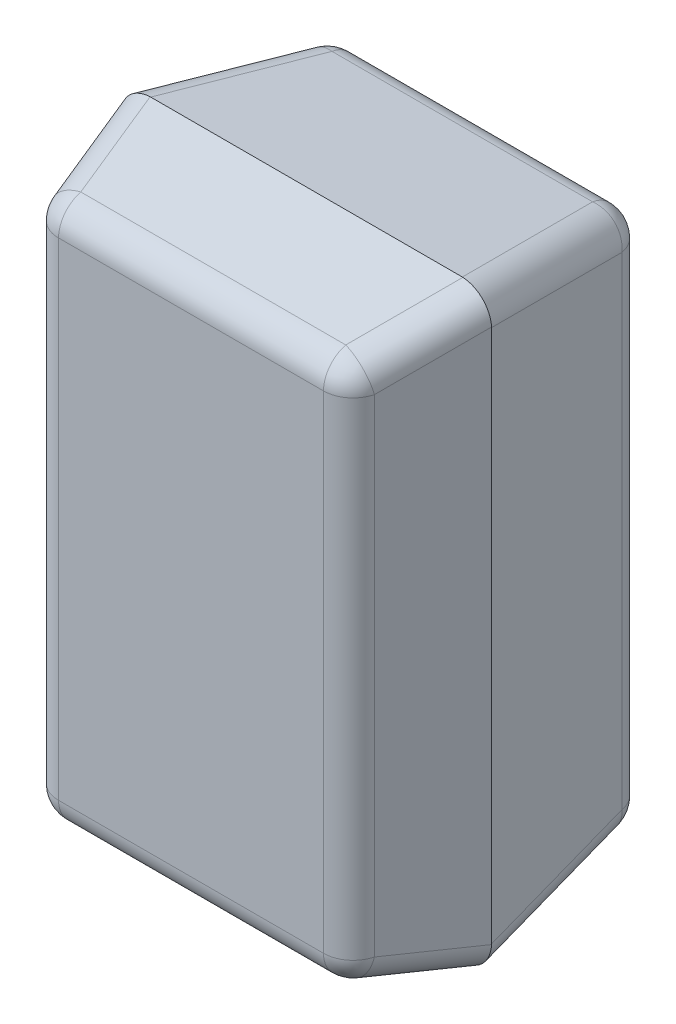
ISO-10303-21;
HEADER;
FILE_DESCRIPTION(('STEP AP214'),'2;1');
FILE_NAME('part.step','',(''),(''),'','','');
FILE_SCHEMA(('AUTOMOTIVE_DESIGN { 1 0 10303 214 1 1 1 1 }'));
ENDSEC;
DATA;
#1=APPLICATION_CONTEXT('core data for automotive mechanical design processes');
#2=APPLICATION_PROTOCOL_DEFINITION('international standard','automotive_design',2000,#1);
#3=PRODUCT_CONTEXT('',#1,'mechanical');
#4=PRODUCT('Part','Part','',(#3));
#5=PRODUCT_RELATED_PRODUCT_CATEGORY('part','',(#4));
#6=PRODUCT_DEFINITION_FORMATION('','',#4);
#7=PRODUCT_DEFINITION_CONTEXT('part definition',#1,'design');
#8=PRODUCT_DEFINITION('design','',#6,#7);
#9=PRODUCT_DEFINITION_SHAPE('','',#8);
#10=(LENGTH_UNIT() NAMED_UNIT(*) SI_UNIT(.MILLI.,.METRE.));
#11=(NAMED_UNIT(*) PLANE_ANGLE_UNIT() SI_UNIT($,.RADIAN.));
#12=(NAMED_UNIT(*) SI_UNIT($,.STERADIAN.) SOLID_ANGLE_UNIT());
#13=UNCERTAINTY_MEASURE_WITH_UNIT(LENGTH_MEASURE(1.E-05),#10,'distance_accuracy_value','');
#14=(GEOMETRIC_REPRESENTATION_CONTEXT(3) GLOBAL_UNCERTAINTY_ASSIGNED_CONTEXT((#13)) GLOBAL_UNIT_ASSIGNED_CONTEXT((#10,
#11,#12)) REPRESENTATION_CONTEXT('',''));
#15=CARTESIAN_POINT('',(0.,0.,0.));
#16=DIRECTION('',(0.,0.,1.));
#17=DIRECTION('',(1.,0.,0.));
#18=AXIS2_PLACEMENT_3D('',#15,#16,#17);
#19=CARTESIAN_POINT('',(0.3125,0.95,0.805));
#20=DIRECTION('',(0.,0.968663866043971,0.248375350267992));
#21=DIRECTION('',(1.,0.,0.));
#22=AXIS2_PLACEMENT_3D('',#19,#20,#21);
#23=PLANE('',#22);
#24=CARTESIAN_POINT('',(0.563185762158,0.938185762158,0.851075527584));
#25=DIRECTION('',(1.20414386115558E-13,-0.96866386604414,-0.248375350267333));
#26=DIRECTION('',(-0.173969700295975,0.244587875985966,-0.953892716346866));
#27=AXIS2_PLACEMENT_3D('',#24,#25,#26);
#28=ELLIPSE('',#27,0.252109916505,0.1);
#29=CARTESIAN_POINT('',(0.526317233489,1.,0.61));
#30=VERTEX_POINT('',#29);
#31=CARTESIAN_POINT('',(0.528123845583,0.999990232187,0.61003809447));
#32=VERTEX_POINT('',#31);
#33=EDGE_CURVE('E417',#30,#32,#28,.T.);
#34=ORIENTED_EDGE('',*,*,#33,.F.);
#35=DIRECTION('',(-1.,0.,0.));
#36=VECTOR('',#35,1.);
#37=CARTESIAN_POINT('',(0.3125,1.,0.61));
#38=LINE('',#37,#36);
#39=CARTESIAN_POINT('',(-0.526317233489,1.,0.61));
#40=VERTEX_POINT('',#39);
#41=EDGE_CURVE('E11',#30,#40,#38,.T.);
#42=ORIENTED_EDGE('',*,*,#41,.T.);
#43=CARTESIAN_POINT('',(-0.563185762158,0.938185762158,0.851075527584));
#44=DIRECTION('',(-1.19984334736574E-13,-0.96866386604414,-0.248375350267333));
#45=DIRECTION('',(0.173969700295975,0.244587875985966,-0.953892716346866));
#46=AXIS2_PLACEMENT_3D('',#43,#44,#45);
#47=ELLIPSE('',#46,0.252109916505,0.1);
#48=CARTESIAN_POINT('',(-0.528123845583,0.999990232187,0.61003809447));
#49=VERTEX_POINT('',#48);
#50=EDGE_CURVE('E459',#49,#40,#47,.T.);
#51=ORIENTED_EDGE('',*,*,#50,.F.);
#52=DIRECTION('',(-0.241051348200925,0.241051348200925,-0.940100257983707));
#53=VECTOR('',#52,1.);
#54=CARTESIAN_POINT('',(-0.444903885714,0.916770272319,0.934595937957));
#55=LINE('',#54,#53);
#56=CARTESIAN_POINT('',(-0.447406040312,0.919272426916,0.924837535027));
#57=VERTEX_POINT('',#56);
#58=EDGE_CURVE('E361',#57,#49,#55,.T.);
#59=ORIENTED_EDGE('',*,*,#58,.F.);
#60=DIRECTION('',(-1.,0.,0.));
#61=VECTOR('',#60,1.);
#62=CARTESIAN_POINT('',(0.15625,0.919272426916,0.924837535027));
#63=LINE('',#62,#61);
#64=CARTESIAN_POINT('',(0.447406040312,0.919272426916,0.924837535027));
#65=VERTEX_POINT('',#64);
#66=EDGE_CURVE('E366',#65,#57,#63,.T.);
#67=ORIENTED_EDGE('',*,*,#66,.F.);
#68=DIRECTION('',(-0.241051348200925,-0.241051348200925,0.940100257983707));
#69=VECTOR('',#68,1.);
#70=CARTESIAN_POINT('',(0.434009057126,0.905875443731,0.97708576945));
#71=LINE('',#70,#69);
#72=EDGE_CURVE('E247',#32,#65,#71,.T.);
#73=ORIENTED_EDGE('',*,*,#72,.F.);
#74=EDGE_LOOP('',(#34,#42,#51,#59,#67,#73));
#75=FACE_BOUND('',#74,.T.);
#76=ADVANCED_FACE('F17',(#75),#23,.T.);
#77=CARTESIAN_POINT('',(-0.575,0.5,0.805));
#78=DIRECTION('',(-0.968663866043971,0.,0.248375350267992));
#79=DIRECTION('',(0.,1.,0.));
#80=AXIS2_PLACEMENT_3D('',#77,#78,#79);
#81=PLANE('',#80);
#82=CARTESIAN_POINT('',(-0.563185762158,0.938185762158,0.851075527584));
#83=DIRECTION('',(0.96866386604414,1.20173557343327E-13,-0.248375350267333));
#84=DIRECTION('',(-0.244587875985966,-0.173969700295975,-0.953892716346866));
#85=AXIS2_PLACEMENT_3D('',#82,#83,#84);
#86=ELLIPSE('',#85,0.252109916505,0.1);
#87=CARTESIAN_POINT('',(-0.625,0.901317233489,0.61));
#88=VERTEX_POINT('',#87);
#89=CARTESIAN_POINT('',(-0.624990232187,0.903123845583,0.61003809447));
#90=VERTEX_POINT('',#89);
#91=EDGE_CURVE('E316',#88,#90,#86,.T.);
#92=ORIENTED_EDGE('',*,*,#91,.F.);
#93=DIRECTION('',(0.,-1.,0.));
#94=VECTOR('',#93,1.);
#95=CARTESIAN_POINT('',(-0.625,0.5,0.61));
#96=LINE('',#95,#94);
#97=CARTESIAN_POINT('',(-0.625,-0.901317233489,0.61));
#98=VERTEX_POINT('',#97);
#99=EDGE_CURVE('E20',#88,#98,#96,.T.);
#100=ORIENTED_EDGE('',*,*,#99,.T.);
#101=CARTESIAN_POINT('',(-0.563185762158,-0.938185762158,0.851075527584));
#102=DIRECTION('',(0.96866386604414,-1.20242365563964E-13,-0.248375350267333));
#103=DIRECTION('',(-0.244587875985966,0.173969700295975,-0.953892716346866));
#104=AXIS2_PLACEMENT_3D('',#101,#102,#103);
#105=ELLIPSE('',#104,0.252109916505,0.1);
#106=CARTESIAN_POINT('',(-0.624990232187,-0.903123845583,0.61003809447));
#107=VERTEX_POINT('',#106);
#108=EDGE_CURVE('E249',#107,#98,#105,.T.);
#109=ORIENTED_EDGE('',*,*,#108,.F.);
#110=DIRECTION('',(-0.241051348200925,-0.241051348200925,-0.940100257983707));
#111=VECTOR('',#110,1.);
#112=CARTESIAN_POINT('',(-0.530875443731,-0.809009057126,0.97708576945));
#113=LINE('',#112,#111);
#114=CARTESIAN_POINT('',(-0.544272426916,-0.822406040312,0.924837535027));
#115=VERTEX_POINT('',#114);
#116=EDGE_CURVE('E414',#115,#107,#113,.T.);
#117=ORIENTED_EDGE('',*,*,#116,.F.);
#118=DIRECTION('',(0.,-1.,0.));
#119=VECTOR('',#118,1.);
#120=CARTESIAN_POINT('',(-0.544272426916,0.25,0.924837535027));
#121=LINE('',#120,#119);
#122=CARTESIAN_POINT('',(-0.544272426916,0.822406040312,0.924837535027));
#123=VERTEX_POINT('',#122);
#124=EDGE_CURVE('E290',#123,#115,#121,.T.);
#125=ORIENTED_EDGE('',*,*,#124,.F.);
#126=DIRECTION('',(0.241051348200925,-0.241051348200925,0.940100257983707));
#127=VECTOR('',#126,1.);
#128=CARTESIAN_POINT('',(-0.541770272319,0.819903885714,0.934595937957));
#129=LINE('',#128,#127);
#130=EDGE_CURVE('E357',#90,#123,#129,.T.);
#131=ORIENTED_EDGE('',*,*,#130,.F.);
#132=EDGE_LOOP('',(#92,#100,#109,#117,#125,#131));
#133=FACE_BOUND('',#132,.T.);
#134=ADVANCED_FACE('F480',(#133),#81,.T.);
#135=CARTESIAN_POINT('',(0.575,-0.5,0.305));
#136=DIRECTION('',(0.986827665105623,0.,-0.161775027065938));
#137=DIRECTION('',(0.,-1.,0.));
#138=AXIS2_PLACEMENT_3D('',#135,#136,#137);
#139=PLANE('',#138);
#140=DIRECTION('',(-0.159698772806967,-0.159698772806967,-0.974162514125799));
#141=VECTOR('',#140,1.);
#142=CARTESIAN_POINT('',(0.555679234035,0.831996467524,0.187143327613));
#143=LINE('',#142,#141);
#144=CARTESIAN_POINT('',(0.625,0.901317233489,0.61));
#145=VERTEX_POINT('',#144);
#146=CARTESIAN_POINT('',(0.538741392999,0.815058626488,0.08382249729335));
#147=VERTEX_POINT('',#146);
#148=EDGE_CURVE('E199',#145,#147,#143,.T.);
#149=ORIENTED_EDGE('',*,*,#148,.F.);
#150=DIRECTION('',(0.,1.,0.));
#151=VECTOR('',#150,1.);
#152=CARTESIAN_POINT('',(0.625,-0.5,0.61));
#153=LINE('',#152,#151);
#154=CARTESIAN_POINT('',(0.625,-0.901317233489,0.61));
#155=VERTEX_POINT('',#154);
#156=EDGE_CURVE('E46',#155,#145,#153,.T.);
#157=ORIENTED_EDGE('',*,*,#156,.F.);
#158=DIRECTION('',(0.159698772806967,-0.159698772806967,0.974162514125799));
#159=VECTOR('',#158,1.);
#160=CARTESIAN_POINT('',(0.560461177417,-0.836778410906,0.216313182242));
#161=LINE('',#160,#159);
#162=CARTESIAN_POINT('',(0.538741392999,-0.815058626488,0.08382249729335));
#163=VERTEX_POINT('',#162);
#164=EDGE_CURVE('E217',#163,#155,#161,.T.);
#165=ORIENTED_EDGE('',*,*,#164,.F.);
#166=DIRECTION('',(0.,-1.,0.));
#167=VECTOR('',#166,1.);
#168=CARTESIAN_POINT('',(0.538741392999,-0.25,0.08382249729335));
#169=LINE('',#168,#167);
#170=EDGE_CURVE('E214',#147,#163,#169,.T.);
#171=ORIENTED_EDGE('',*,*,#170,.F.);
#172=EDGE_LOOP('',(#149,#157,#165,#171));
#173=FACE_BOUND('',#172,.T.);
#174=ADVANCED_FACE('F215',(#173),#139,.T.);
#175=CARTESIAN_POINT('',(-0.3125,-0.95,0.305));
#176=DIRECTION('',(0.,-0.986827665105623,-0.161775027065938));
#177=DIRECTION('',(0.,0.161775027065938,-0.986827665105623));
#178=AXIS2_PLACEMENT_3D('',#175,#176,#177);
#179=PLANE('',#178);
#180=DIRECTION('',(-0.159698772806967,0.159698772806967,-0.974162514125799));
#181=VECTOR('',#180,1.);
#182=CARTESIAN_POINT('',(0.461778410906,-0.935461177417,0.216313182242));
#183=LINE('',#182,#181);
#184=CARTESIAN_POINT('',(0.526317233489,-1.,0.61));
#185=VERTEX_POINT('',#184);
#186=CARTESIAN_POINT('',(0.440058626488,-0.913741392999,0.08382249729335));
#187=VERTEX_POINT('',#186);
#188=EDGE_CURVE('E302',#185,#187,#183,.T.);
#189=ORIENTED_EDGE('',*,*,#188,.F.);
#190=DIRECTION('',(1.,0.,0.));
#191=VECTOR('',#190,1.);
#192=CARTESIAN_POINT('',(-0.3125,-1.,0.61));
#193=LINE('',#192,#191);
#194=CARTESIAN_POINT('',(-0.526317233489,-1.,0.61));
#195=VERTEX_POINT('',#194);
#196=EDGE_CURVE('E336',#195,#185,#193,.T.);
#197=ORIENTED_EDGE('',*,*,#196,.F.);
#198=DIRECTION('',(-0.159698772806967,-0.159698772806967,0.974162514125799));
#199=VECTOR('',#198,1.);
#200=CARTESIAN_POINT('',(-0.456996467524,-0.930679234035,0.187143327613));
#201=LINE('',#200,#199);
#202=CARTESIAN_POINT('',(-0.440058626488,-0.913741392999,0.08382249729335));
#203=VERTEX_POINT('',#202);
#204=EDGE_CURVE('E367',#203,#195,#201,.T.);
#205=ORIENTED_EDGE('',*,*,#204,.F.);
#206=DIRECTION('',(-1.,0.,0.));
#207=VECTOR('',#206,1.);
#208=CARTESIAN_POINT('',(-0.15625,-0.913741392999,0.08382249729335));
#209=LINE('',#208,#207);
#210=EDGE_CURVE('E321',#187,#203,#209,.T.);
#211=ORIENTED_EDGE('',*,*,#210,.F.);
#212=EDGE_LOOP('',(#189,#197,#205,#211));
#213=FACE_BOUND('',#212,.T.);
#214=ADVANCED_FACE('F524',(#213),#179,.T.);
#215=CARTESIAN_POINT('',(0.,0.,0.));
#216=DIRECTION('',(0.,0.,1.));
#217=DIRECTION('',(1.,0.,0.));
#218=AXIS2_PLACEMENT_3D('',#215,#216,#217);
#219=PLANE('',#218);
#220=DIRECTION('',(0.,-1.,0.));
#221=VECTOR('',#220,1.);
#222=CARTESIAN_POINT('',(-0.440058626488,0.25,0.));
#223=LINE('',#222,#221);
#224=CARTESIAN_POINT('',(-0.440058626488,0.815058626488,0.));
#225=VERTEX_POINT('',#224);
#226=CARTESIAN_POINT('',(-0.440058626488,-0.815058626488,0.));
#227=VERTEX_POINT('',#226);
#228=EDGE_CURVE('E447',#225,#227,#223,.T.);
#229=ORIENTED_EDGE('',*,*,#228,.F.);
#230=DIRECTION('',(-1.,0.,0.));
#231=VECTOR('',#230,1.);
#232=CARTESIAN_POINT('',(0.15625,0.815058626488,0.));
#233=LINE('',#232,#231);
#234=CARTESIAN_POINT('',(0.440058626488,0.815058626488,0.));
#235=VERTEX_POINT('',#234);
#236=EDGE_CURVE('E211',#235,#225,#233,.T.);
#237=ORIENTED_EDGE('',*,*,#236,.F.);
#238=DIRECTION('',(0.,1.,0.));
#239=VECTOR('',#238,1.);
#240=CARTESIAN_POINT('',(0.440058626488,-0.25,0.));
#241=LINE('',#240,#239);
#242=CARTESIAN_POINT('',(0.440058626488,-0.815058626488,0.));
#243=VERTEX_POINT('',#242);
#244=EDGE_CURVE('E223',#243,#235,#241,.T.);
#245=ORIENTED_EDGE('',*,*,#244,.F.);
#246=DIRECTION('',(1.,0.,0.));
#247=VECTOR('',#246,1.);
#248=CARTESIAN_POINT('',(-0.15625,-0.815058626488,0.));
#249=LINE('',#248,#247);
#250=EDGE_CURVE('E318',#227,#243,#249,.T.);
#251=ORIENTED_EDGE('',*,*,#250,.F.);
#252=EDGE_LOOP('',(#229,#237,#245,#251));
#253=FACE_BOUND('',#252,.T.);
#254=ADVANCED_FACE('F505',(#253),#219,.F.);
#255=CARTESIAN_POINT('',(0.,0.,1.));
#256=DIRECTION('',(0.,0.,1.));
#257=DIRECTION('',(1.,0.,0.));
#258=AXIS2_PLACEMENT_3D('',#255,#256,#257);
#259=PLANE('',#258);
#260=DIRECTION('',(1.,0.,0.));
#261=VECTOR('',#260,1.);
#262=CARTESIAN_POINT('',(0.15625,0.822406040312,1.));
#263=LINE('',#262,#261);
#264=CARTESIAN_POINT('',(-0.447406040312,0.822406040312,1.));
#265=VERTEX_POINT('',#264);
#266=CARTESIAN_POINT('',(0.447406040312,0.822406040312,1.));
#267=VERTEX_POINT('',#266);
#268=EDGE_CURVE('E362',#265,#267,#263,.T.);
#269=ORIENTED_EDGE('',*,*,#268,.F.);
#270=DIRECTION('',(0.,1.,0.));
#271=VECTOR('',#270,1.);
#272=CARTESIAN_POINT('',(-0.447406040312,0.25,1.));
#273=LINE('',#272,#271);
#274=CARTESIAN_POINT('',(-0.447406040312,-0.822406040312,1.));
#275=VERTEX_POINT('',#274);
#276=EDGE_CURVE('E286',#275,#265,#273,.T.);
#277=ORIENTED_EDGE('',*,*,#276,.F.);
#278=DIRECTION('',(-1.,0.,0.));
#279=VECTOR('',#278,1.);
#280=CARTESIAN_POINT('',(-0.15625,-0.822406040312,1.));
#281=LINE('',#280,#279);
#282=CARTESIAN_POINT('',(0.447406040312,-0.822406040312,1.));
#283=VERTEX_POINT('',#282);
#284=EDGE_CURVE('E434',#283,#275,#281,.T.);
#285=ORIENTED_EDGE('',*,*,#284,.F.);
#286=DIRECTION('',(0.,-1.,0.));
#287=VECTOR('',#286,1.);
#288=CARTESIAN_POINT('',(0.447406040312,-0.25,1.));
#289=LINE('',#288,#287);
#290=EDGE_CURVE('E383',#267,#283,#289,.T.);
#291=ORIENTED_EDGE('',*,*,#290,.F.);
#292=EDGE_LOOP('',(#269,#277,#285,#291));
#293=FACE_BOUND('',#292,.T.);
#294=ADVANCED_FACE('F880',(#293),#259,.T.);
#295=CARTESIAN_POINT('',(0.3125,0.95,0.305));
#296=DIRECTION('',(0.,0.986827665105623,-0.161775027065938));
#297=DIRECTION('',(-1.,0.,0.));
#298=AXIS2_PLACEMENT_3D('',#295,#296,#297);
#299=PLANE('',#298);
#300=DIRECTION('',(0.159698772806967,0.159698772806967,0.974162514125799));
#301=VECTOR('',#300,1.);
#302=CARTESIAN_POINT('',(0.456996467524,0.930679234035,0.187143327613));
#303=LINE('',#302,#301);
#304=CARTESIAN_POINT('',(0.440058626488,0.913741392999,0.08382249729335));
#305=VERTEX_POINT('',#304);
#306=EDGE_CURVE('E210',#305,#30,#303,.T.);
#307=ORIENTED_EDGE('',*,*,#306,.F.);
#308=DIRECTION('',(1.,0.,0.));
#309=VECTOR('',#308,1.);
#310=CARTESIAN_POINT('',(0.15625,0.913741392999,0.08382249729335));
#311=LINE('',#310,#309);
#312=CARTESIAN_POINT('',(-0.440058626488,0.913741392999,0.08382249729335));
#313=VERTEX_POINT('',#312);
#314=EDGE_CURVE('E463',#313,#305,#311,.T.);
#315=ORIENTED_EDGE('',*,*,#314,.F.);
#316=DIRECTION('',(0.159698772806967,-0.159698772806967,-0.974162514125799));
#317=VECTOR('',#316,1.);
#318=CARTESIAN_POINT('',(-0.461778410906,0.935461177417,0.216313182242));
#319=LINE('',#318,#317);
#320=EDGE_CURVE('E317',#40,#313,#319,.T.);
#321=ORIENTED_EDGE('',*,*,#320,.F.);
#322=ORIENTED_EDGE('',*,*,#41,.F.);
#323=EDGE_LOOP('',(#307,#315,#321,#322));
#324=FACE_BOUND('',#323,.T.);
#325=ADVANCED_FACE('F872',(#324),#299,.T.);
#326=CARTESIAN_POINT('',(-0.575,0.5,0.305));
#327=DIRECTION('',(-0.986827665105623,0.,-0.161775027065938));
#328=DIRECTION('',(-0.161775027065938,0.,0.986827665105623));
#329=AXIS2_PLACEMENT_3D('',#326,#327,#328);
#330=PLANE('',#329);
#331=DIRECTION('',(-0.159698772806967,0.159698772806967,0.974162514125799));
#332=VECTOR('',#331,1.);
#333=CARTESIAN_POINT('',(-0.560461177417,0.836778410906,0.216313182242));
#334=LINE('',#333,#332);
#335=CARTESIAN_POINT('',(-0.538741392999,0.815058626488,0.08382249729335));
#336=VERTEX_POINT('',#335);
#337=EDGE_CURVE('E312',#336,#88,#334,.T.);
#338=ORIENTED_EDGE('',*,*,#337,.F.);
#339=DIRECTION('',(0.,1.,0.));
#340=VECTOR('',#339,1.);
#341=CARTESIAN_POINT('',(-0.538741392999,0.25,0.08382249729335));
#342=LINE('',#341,#340);
#343=CARTESIAN_POINT('',(-0.538741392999,-0.815058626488,0.08382249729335));
#344=VERTEX_POINT('',#343);
#345=EDGE_CURVE('E289',#344,#336,#342,.T.);
#346=ORIENTED_EDGE('',*,*,#345,.F.);
#347=DIRECTION('',(0.159698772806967,0.159698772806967,-0.974162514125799));
#348=VECTOR('',#347,1.);
#349=CARTESIAN_POINT('',(-0.555679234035,-0.831996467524,0.187143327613));
#350=LINE('',#349,#348);
#351=EDGE_CURVE('E371',#98,#344,#350,.T.);
#352=ORIENTED_EDGE('',*,*,#351,.F.);
#353=ORIENTED_EDGE('',*,*,#99,.F.);
#354=EDGE_LOOP('',(#338,#346,#352,#353));
#355=FACE_BOUND('',#354,.T.);
#356=ADVANCED_FACE('F490',(#355),#330,.T.);
#357=CARTESIAN_POINT('',(-0.3125,-0.95,0.805));
#358=DIRECTION('',(0.,-0.968663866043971,0.248375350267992));
#359=DIRECTION('',(-1.,0.,0.));
#360=AXIS2_PLACEMENT_3D('',#357,#358,#359);
#361=PLANE('',#360);
#362=CARTESIAN_POINT('',(0.563185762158,-0.938185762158,0.851075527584));
#363=DIRECTION('',(1.20104749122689E-13,0.96866386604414,-0.248375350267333));
#364=DIRECTION('',(-0.173969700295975,-0.244587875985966,-0.953892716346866));
#365=AXIS2_PLACEMENT_3D('',#362,#363,#364);
#366=ELLIPSE('',#365,0.252109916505,0.1);
#367=CARTESIAN_POINT('',(0.528123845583,-0.999990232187,0.61003809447));
#368=VERTEX_POINT('',#367);
#369=EDGE_CURVE('E440',#368,#185,#366,.T.);
#370=ORIENTED_EDGE('',*,*,#369,.F.);
#371=DIRECTION('',(0.241051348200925,-0.241051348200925,-0.940100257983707));
#372=VECTOR('',#371,1.);
#373=CARTESIAN_POINT('',(0.444903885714,-0.916770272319,0.934595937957));
#374=LINE('',#373,#372);
#375=CARTESIAN_POINT('',(0.447406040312,-0.919272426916,0.924837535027));
#376=VERTEX_POINT('',#375);
#377=EDGE_CURVE('E330',#376,#368,#374,.T.);
#378=ORIENTED_EDGE('',*,*,#377,.F.);
#379=DIRECTION('',(1.,0.,0.));
#380=VECTOR('',#379,1.);
#381=CARTESIAN_POINT('',(-0.15625,-0.919272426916,0.924837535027));
#382=LINE('',#381,#380);
#383=CARTESIAN_POINT('',(-0.447406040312,-0.919272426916,0.924837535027));
#384=VERTEX_POINT('',#383);
#385=EDGE_CURVE('E253',#384,#376,#382,.T.);
#386=ORIENTED_EDGE('',*,*,#385,.F.);
#387=DIRECTION('',(0.241051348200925,0.241051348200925,0.940100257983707));
#388=VECTOR('',#387,1.);
#389=CARTESIAN_POINT('',(-0.434009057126,-0.905875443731,0.97708576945));
#390=LINE('',#389,#388);
#391=CARTESIAN_POINT('',(-0.528123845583,-0.999990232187,0.61003809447));
#392=VERTEX_POINT('',#391);
#393=EDGE_CURVE('E340',#392,#384,#390,.T.);
#394=ORIENTED_EDGE('',*,*,#393,.F.);
#395=CARTESIAN_POINT('',(-0.563185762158,-0.938185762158,0.851075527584));
#396=DIRECTION('',(-1.20302572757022E-13,0.96866386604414,-0.248375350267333));
#397=DIRECTION('',(0.173969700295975,-0.244587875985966,-0.953892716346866));
#398=AXIS2_PLACEMENT_3D('',#395,#396,#397);
#399=ELLIPSE('',#398,0.252109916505,0.1);
#400=EDGE_CURVE('E254',#195,#392,#399,.T.);
#401=ORIENTED_EDGE('',*,*,#400,.F.);
#402=ORIENTED_EDGE('',*,*,#196,.T.);
#403=EDGE_LOOP('',(#370,#378,#386,#394,#401,#402));
#404=FACE_BOUND('',#403,.T.);
#405=ADVANCED_FACE('F530',(#404),#361,.T.);
#406=CARTESIAN_POINT('',(0.575,-0.5,0.805));
#407=DIRECTION('',(0.968663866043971,0.,0.248375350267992));
#408=DIRECTION('',(0.,-1.,0.));
#409=AXIS2_PLACEMENT_3D('',#406,#407,#408);
#410=PLANE('',#409);
#411=CARTESIAN_POINT('',(0.563185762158,0.938185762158,0.851075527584));
#412=DIRECTION('',(-0.96866386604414,1.2008754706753E-13,-0.248375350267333));
#413=DIRECTION('',(0.244587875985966,-0.173969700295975,-0.953892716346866));
#414=AXIS2_PLACEMENT_3D('',#411,#412,#413);
#415=ELLIPSE('',#414,0.252109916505,0.1);
#416=CARTESIAN_POINT('',(0.624990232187,0.903123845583,0.61003809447));
#417=VERTEX_POINT('',#416);
#418=EDGE_CURVE('E207',#417,#145,#415,.T.);
#419=ORIENTED_EDGE('',*,*,#418,.F.);
#420=DIRECTION('',(0.241051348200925,0.241051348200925,-0.940100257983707));
#421=VECTOR('',#420,1.);
#422=CARTESIAN_POINT('',(0.530875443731,0.809009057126,0.97708576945));
#423=LINE('',#422,#421);
#424=CARTESIAN_POINT('',(0.544272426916,0.822406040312,0.924837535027));
#425=VERTEX_POINT('',#424);
#426=EDGE_CURVE('E282',#425,#417,#423,.T.);
#427=ORIENTED_EDGE('',*,*,#426,.F.);
#428=DIRECTION('',(0.,1.,0.));
#429=VECTOR('',#428,1.);
#430=CARTESIAN_POINT('',(0.544272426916,-0.25,0.924837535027));
#431=LINE('',#430,#429);
#432=CARTESIAN_POINT('',(0.544272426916,-0.822406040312,0.924837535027));
#433=VERTEX_POINT('',#432);
#434=EDGE_CURVE('E329',#433,#425,#431,.T.);
#435=ORIENTED_EDGE('',*,*,#434,.F.);
#436=DIRECTION('',(-0.241051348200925,0.241051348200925,0.940100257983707));
#437=VECTOR('',#436,1.);
#438=CARTESIAN_POINT('',(0.541770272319,-0.819903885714,0.934595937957));
#439=LINE('',#438,#437);
#440=CARTESIAN_POINT('',(0.624990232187,-0.903123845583,0.61003809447));
#441=VERTEX_POINT('',#440);
#442=EDGE_CURVE('E394',#441,#433,#439,.T.);
#443=ORIENTED_EDGE('',*,*,#442,.F.);
#444=CARTESIAN_POINT('',(0.563185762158,-0.938185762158,0.851075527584));
#445=DIRECTION('',(-0.96866386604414,-1.20328375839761E-13,-0.248375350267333));
#446=DIRECTION('',(0.244587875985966,0.173969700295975,-0.953892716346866));
#447=AXIS2_PLACEMENT_3D('',#444,#445,#446);
#448=ELLIPSE('',#447,0.252109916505,0.1);
#449=EDGE_CURVE('E301',#155,#441,#448,.T.);
#450=ORIENTED_EDGE('',*,*,#449,.F.);
#451=ORIENTED_EDGE('',*,*,#156,.T.);
#452=EDGE_LOOP('',(#419,#427,#435,#443,#450,#451));
#453=FACE_BOUND('',#452,.T.);
#454=ADVANCED_FACE('F850',(#453),#410,.T.);
#455=CARTESIAN_POINT('',(0.456996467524,0.831996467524,0.20332083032));
#456=DIRECTION('',(-0.159698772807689,-0.159698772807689,-0.974162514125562));
#457=DIRECTION('',(0.688836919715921,0.688836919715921,-0.225848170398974));
#458=AXIS2_PLACEMENT_3D('',#455,#456,#457);
#459=CYLINDRICAL_SURFACE('',#458,0.1);
#460=ORIENTED_EDGE('',*,*,#148,.T.);
#461=CARTESIAN_POINT('',(0.440058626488,0.815058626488,0.1));
#462=DIRECTION('',(-0.159698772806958,-0.159698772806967,-0.9741625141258));
#463=DIRECTION('',(0.986827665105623,0.,-0.161775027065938));
#464=AXIS2_PLACEMENT_3D('',#461,#462,#463);
#465=CIRCLE('',#464,0.1);
#466=EDGE_CURVE('E204',#305,#147,#465,.T.);
#467=ORIENTED_EDGE('',*,*,#466,.F.);
#468=ORIENTED_EDGE('',*,*,#306,.T.);
#469=ORIENTED_EDGE('',*,*,#33,.T.);
#470=CARTESIAN_POINT('',(0.52292411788,0.89792411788,0.605479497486));
#471=DIRECTION('',(-0.0424215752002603,-0.0424215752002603,0.998198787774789));
#472=DIRECTION('',(0.705833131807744,0.705833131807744,0.0599931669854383));
#473=AXIS2_PLACEMENT_3D('',#470,#471,#472);
#474=ELLIPSE('',#473,0.104290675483,0.1);
#475=EDGE_CURVE('E281',#417,#32,#474,.T.);
#476=ORIENTED_EDGE('',*,*,#475,.F.);
#477=ORIENTED_EDGE('',*,*,#418,.T.);
#478=EDGE_LOOP('',(#460,#467,#468,#469,#476,#477));
#479=FACE_BOUND('',#478,.T.);
#480=ADVANCED_FACE('F201',(#479),#459,.T.);
#481=CARTESIAN_POINT('',(0.15625,0.815058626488,0.1));
#482=DIRECTION('',(-1.,0.,0.));
#483=DIRECTION('',(0.,0.64738897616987,-0.762159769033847));
#484=AXIS2_PLACEMENT_3D('',#481,#482,#483);
#485=CYLINDRICAL_SURFACE('',#484,0.1);
#486=CARTESIAN_POINT('',(-0.440058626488,0.815058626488,0.1));
#487=DIRECTION('',(-1.,0.,0.));
#488=DIRECTION('',(0.,0.,-1.));
#489=AXIS2_PLACEMENT_3D('',#486,#487,#488);
#490=CIRCLE('',#489,0.1);
#491=EDGE_CURVE('E260',#313,#225,#490,.T.);
#492=ORIENTED_EDGE('',*,*,#491,.F.);
#493=ORIENTED_EDGE('',*,*,#314,.T.);
#494=CARTESIAN_POINT('',(0.440058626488,0.815058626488,0.1));
#495=DIRECTION('',(1.,0.,0.));
#496=DIRECTION('',(0.,0.986827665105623,-0.161775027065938));
#497=AXIS2_PLACEMENT_3D('',#494,#495,#496);
#498=CIRCLE('',#497,0.1);
#499=EDGE_CURVE('E231',#235,#305,#498,.T.);
#500=ORIENTED_EDGE('',*,*,#499,.F.);
#501=ORIENTED_EDGE('',*,*,#236,.T.);
#502=EDGE_LOOP('',(#492,#493,#500,#501));
#503=FACE_BOUND('',#502,.T.);
#504=ADVANCED_FACE('F502',(#503),#485,.T.);
#505=CARTESIAN_POINT('',(-0.461778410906,0.836778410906,0.232490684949));
#506=DIRECTION('',(0.159698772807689,-0.159698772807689,-0.974162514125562));
#507=DIRECTION('',(-0.688836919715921,0.688836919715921,-0.225848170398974));
#508=AXIS2_PLACEMENT_3D('',#505,#506,#507);
#509=CYLINDRICAL_SURFACE('',#508,0.1);
#510=ORIENTED_EDGE('',*,*,#320,.T.);
#511=CARTESIAN_POINT('',(-0.440058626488,0.815058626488,0.1));
#512=DIRECTION('',(0.159698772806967,-0.159698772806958,-0.9741625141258));
#513=DIRECTION('',(0.,0.986827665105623,-0.161775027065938));
#514=AXIS2_PLACEMENT_3D('',#511,#512,#513);
#515=CIRCLE('',#514,0.1);
#516=EDGE_CURVE('E261',#336,#313,#515,.T.);
#517=ORIENTED_EDGE('',*,*,#516,.F.);
#518=ORIENTED_EDGE('',*,*,#337,.T.);
#519=ORIENTED_EDGE('',*,*,#91,.T.);
#520=CARTESIAN_POINT('',(-0.52292411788,0.89792411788,0.605479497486));
#521=DIRECTION('',(0.0424215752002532,-0.0424215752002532,0.998198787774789));
#522=DIRECTION('',(0.705833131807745,-0.705833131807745,-0.0599931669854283));
#523=AXIS2_PLACEMENT_3D('',#520,#521,#522);
#524=ELLIPSE('',#523,0.104290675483,0.1);
#525=EDGE_CURVE('E277',#49,#90,#524,.T.);
#526=ORIENTED_EDGE('',*,*,#525,.F.);
#527=ORIENTED_EDGE('',*,*,#50,.T.);
#528=EDGE_LOOP('',(#510,#517,#518,#519,#526,#527));
#529=FACE_BOUND('',#528,.T.);
#530=ADVANCED_FACE('F497',(#529),#509,.T.);
#531=CARTESIAN_POINT('',(0.461778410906,-0.836778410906,0.232490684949));
#532=DIRECTION('',(0.159698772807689,-0.159698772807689,0.974162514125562));
#533=DIRECTION('',(0.688836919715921,-0.688836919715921,-0.225848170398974));
#534=AXIS2_PLACEMENT_3D('',#531,#532,#533);
#535=CYLINDRICAL_SURFACE('',#534,0.1);
#536=ORIENTED_EDGE('',*,*,#188,.T.);
#537=CARTESIAN_POINT('',(0.440058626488,-0.815058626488,0.1));
#538=DIRECTION('',(-0.159698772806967,0.159698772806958,-0.9741625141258));
#539=DIRECTION('',(0.,-0.986827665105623,-0.161775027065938));
#540=AXIS2_PLACEMENT_3D('',#537,#538,#539);
#541=CIRCLE('',#540,0.1);
#542=EDGE_CURVE('E224',#163,#187,#541,.T.);
#543=ORIENTED_EDGE('',*,*,#542,.F.);
#544=ORIENTED_EDGE('',*,*,#164,.T.);
#545=ORIENTED_EDGE('',*,*,#449,.T.);
#546=CARTESIAN_POINT('',(0.52292411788,-0.89792411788,0.605479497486));
#547=DIRECTION('',(-0.0424215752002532,0.0424215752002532,0.998198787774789));
#548=DIRECTION('',(0.705833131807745,-0.705833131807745,0.0599931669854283));
#549=AXIS2_PLACEMENT_3D('',#546,#547,#548);
#550=ELLIPSE('',#549,0.104290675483,0.1);
#551=EDGE_CURVE('E325',#368,#441,#550,.T.);
#552=ORIENTED_EDGE('',*,*,#551,.F.);
#553=ORIENTED_EDGE('',*,*,#369,.T.);
#554=EDGE_LOOP('',(#536,#543,#544,#545,#552,#553));
#555=FACE_BOUND('',#554,.T.);
#556=ADVANCED_FACE('F820',(#555),#535,.T.);
#557=CARTESIAN_POINT('',(-0.15625,-0.815058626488,0.1));
#558=DIRECTION('',(1.,0.,0.));
#559=DIRECTION('',(0.,-0.64738897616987,-0.762159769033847));
#560=AXIS2_PLACEMENT_3D('',#557,#558,#559);
#561=CYLINDRICAL_SURFACE('',#560,0.1);
#562=CARTESIAN_POINT('',(0.440058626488,-0.815058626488,0.1));
#563=DIRECTION('',(1.,0.,0.));
#564=DIRECTION('',(0.,0.,-1.));
#565=AXIS2_PLACEMENT_3D('',#562,#563,#564);
#566=CIRCLE('',#565,0.1);
#567=EDGE_CURVE('E255',#187,#243,#566,.T.);
#568=ORIENTED_EDGE('',*,*,#567,.F.);
#569=ORIENTED_EDGE('',*,*,#210,.T.);
#570=CARTESIAN_POINT('',(-0.440058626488,-0.815058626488,0.1));
#571=DIRECTION('',(-1.,0.,0.));
#572=DIRECTION('',(0.,-0.986827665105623,-0.161775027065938));
#573=AXIS2_PLACEMENT_3D('',#570,#571,#572);
#574=CIRCLE('',#573,0.1);
#575=EDGE_CURVE('E403',#227,#203,#574,.T.);
#576=ORIENTED_EDGE('',*,*,#575,.F.);
#577=ORIENTED_EDGE('',*,*,#250,.T.);
#578=EDGE_LOOP('',(#568,#569,#576,#577));
#579=FACE_BOUND('',#578,.T.);
#580=ADVANCED_FACE('F519',(#579),#561,.T.);
#581=CARTESIAN_POINT('',(-0.440058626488,0.25,0.1));
#582=DIRECTION('',(0.,-1.,0.));
#583=DIRECTION('',(-0.64738897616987,0.,-0.762159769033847));
#584=AXIS2_PLACEMENT_3D('',#581,#582,#583);
#585=CYLINDRICAL_SURFACE('',#584,0.1);
#586=CARTESIAN_POINT('',(-0.440058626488,-0.815058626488,0.1));
#587=DIRECTION('',(0.,-1.,0.));
#588=DIRECTION('',(0.,0.,-1.));
#589=AXIS2_PLACEMENT_3D('',#586,#587,#588);
#590=CIRCLE('',#589,0.1);
#591=EDGE_CURVE('E270',#344,#227,#590,.T.);
#592=ORIENTED_EDGE('',*,*,#591,.F.);
#593=ORIENTED_EDGE('',*,*,#345,.T.);
#594=CARTESIAN_POINT('',(-0.440058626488,0.815058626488,0.1));
#595=DIRECTION('',(0.,1.,0.));
#596=DIRECTION('',(-0.986827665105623,0.,-0.161775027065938));
#597=AXIS2_PLACEMENT_3D('',#594,#595,#596);
#598=CIRCLE('',#597,0.1);
#599=EDGE_CURVE('E264',#225,#336,#598,.T.);
#600=ORIENTED_EDGE('',*,*,#599,.F.);
#601=ORIENTED_EDGE('',*,*,#228,.T.);
#602=EDGE_LOOP('',(#592,#593,#600,#601));
#603=FACE_BOUND('',#602,.T.);
#604=ADVANCED_FACE('F494',(#603),#585,.T.);
#605=CARTESIAN_POINT('',(-0.447406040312,0.25,0.9));
#606=DIRECTION('',(0.,1.,0.));
#607=DIRECTION('',(-0.613035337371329,0.,0.790055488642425));
#608=AXIS2_PLACEMENT_3D('',#605,#606,#607);
#609=CYLINDRICAL_SURFACE('',#608,0.1);
#610=CARTESIAN_POINT('',(-0.447406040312,0.822406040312,0.9));
#611=DIRECTION('',(0.,1.,0.));
#612=DIRECTION('',(0.,0.,1.));
#613=AXIS2_PLACEMENT_3D('',#610,#611,#612);
#614=CIRCLE('',#613,0.1);
#615=EDGE_CURVE('E344',#123,#265,#614,.T.);
#616=ORIENTED_EDGE('',*,*,#615,.F.);
#617=ORIENTED_EDGE('',*,*,#124,.T.);
#618=CARTESIAN_POINT('',(-0.447406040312,-0.822406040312,0.9));
#619=DIRECTION('',(0.,-1.,0.));
#620=DIRECTION('',(-0.968663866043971,0.,0.248375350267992));
#621=AXIS2_PLACEMENT_3D('',#618,#619,#620);
#622=CIRCLE('',#621,0.1);
#623=EDGE_CURVE('E266',#275,#115,#622,.T.);
#624=ORIENTED_EDGE('',*,*,#623,.F.);
#625=ORIENTED_EDGE('',*,*,#276,.T.);
#626=EDGE_LOOP('',(#616,#617,#624,#625));
#627=FACE_BOUND('',#626,.T.);
#628=ADVANCED_FACE('F541',(#627),#609,.T.);
#629=CARTESIAN_POINT('',(-0.15625,-0.822406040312,0.9));
#630=DIRECTION('',(-1.,0.,0.));
#631=DIRECTION('',(0.,-0.613035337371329,0.790055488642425));
#632=AXIS2_PLACEMENT_3D('',#629,#630,#631);
#633=CYLINDRICAL_SURFACE('',#632,0.1);
#634=CARTESIAN_POINT('',(-0.447406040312,-0.822406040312,0.9));
#635=DIRECTION('',(-1.,0.,0.));
#636=DIRECTION('',(0.,0.,1.));
#637=AXIS2_PLACEMENT_3D('',#634,#635,#636);
#638=CIRCLE('',#637,0.1);
#639=EDGE_CURVE('E337',#384,#275,#638,.T.);
#640=ORIENTED_EDGE('',*,*,#639,.F.);
#641=ORIENTED_EDGE('',*,*,#385,.T.);
#642=CARTESIAN_POINT('',(0.447406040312,-0.822406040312,0.9));
#643=DIRECTION('',(1.,0.,0.));
#644=DIRECTION('',(0.,-0.968663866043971,0.248375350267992));
#645=AXIS2_PLACEMENT_3D('',#642,#643,#644);
#646=CIRCLE('',#645,0.1);
#647=EDGE_CURVE('E272',#283,#376,#646,.T.);
#648=ORIENTED_EDGE('',*,*,#647,.F.);
#649=ORIENTED_EDGE('',*,*,#284,.T.);
#650=EDGE_LOOP('',(#640,#641,#648,#649));
#651=FACE_BOUND('',#650,.T.);
#652=ADVANCED_FACE('F535',(#651),#633,.T.);
#653=CARTESIAN_POINT('',(-0.456996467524,-0.831996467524,0.20332083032));
#654=DIRECTION('',(0.159698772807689,0.159698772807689,-0.974162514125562));
#655=DIRECTION('',(-0.688836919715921,-0.688836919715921,-0.225848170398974));
#656=AXIS2_PLACEMENT_3D('',#653,#654,#655);
#657=CYLINDRICAL_SURFACE('',#656,0.1);
#658=ORIENTED_EDGE('',*,*,#351,.T.);
#659=CARTESIAN_POINT('',(-0.440058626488,-0.815058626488,0.1));
#660=DIRECTION('',(0.159698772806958,0.159698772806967,-0.9741625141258));
#661=DIRECTION('',(-0.986827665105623,0.,-0.161775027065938));
#662=AXIS2_PLACEMENT_3D('',#659,#660,#661);
#663=CIRCLE('',#662,0.1);
#664=EDGE_CURVE('E356',#203,#344,#663,.T.);
#665=ORIENTED_EDGE('',*,*,#664,.F.);
#666=ORIENTED_EDGE('',*,*,#204,.T.);
#667=ORIENTED_EDGE('',*,*,#400,.T.);
#668=CARTESIAN_POINT('',(-0.52292411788,-0.89792411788,0.605479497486));
#669=DIRECTION('',(0.0424215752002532,0.0424215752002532,0.998198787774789));
#670=DIRECTION('',(-0.705833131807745,-0.705833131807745,0.0599931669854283));
#671=AXIS2_PLACEMENT_3D('',#668,#669,#670);
#672=ELLIPSE('',#671,0.104290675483,0.1);
#673=EDGE_CURVE('E421',#107,#392,#672,.T.);
#674=ORIENTED_EDGE('',*,*,#673,.F.);
#675=ORIENTED_EDGE('',*,*,#108,.T.);
#676=EDGE_LOOP('',(#658,#665,#666,#667,#674,#675));
#677=FACE_BOUND('',#676,.T.);
#678=ADVANCED_FACE('F487',(#677),#657,.T.);
#679=CARTESIAN_POINT('',(-0.434009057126,-0.809009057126,0.952248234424));
#680=DIRECTION('',(0.241051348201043,0.241051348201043,0.940100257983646));
#681=DIRECTION('',(-0.664751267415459,-0.664751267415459,0.340898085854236));
#682=AXIS2_PLACEMENT_3D('',#679,#680,#681);
#683=CYLINDRICAL_SURFACE('',#682,0.1);
#684=ORIENTED_EDGE('',*,*,#393,.T.);
#685=CARTESIAN_POINT('',(-0.447406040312,-0.822406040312,0.9));
#686=DIRECTION('',(0.241051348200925,0.24105134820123,0.940100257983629));
#687=DIRECTION('',(0.,-0.968663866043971,0.248375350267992));
#688=AXIS2_PLACEMENT_3D('',#685,#686,#687);
#689=CIRCLE('',#688,0.1);
#690=EDGE_CURVE('E269',#115,#384,#689,.T.);
#691=ORIENTED_EDGE('',*,*,#690,.F.);
#692=ORIENTED_EDGE('',*,*,#116,.T.);
#693=ORIENTED_EDGE('',*,*,#673,.T.);
#694=EDGE_LOOP('',(#684,#691,#692,#693));
#695=FACE_BOUND('',#694,.T.);
#696=ADVANCED_FACE('F527',(#695),#683,.T.);
#697=CARTESIAN_POINT('',(-0.447406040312,-0.822406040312,0.9));
#698=DIRECTION('',(0.259385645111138,-0.87868222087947,-0.400795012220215));
#699=DIRECTION('',(-0.477407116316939,-0.477407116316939,0.737675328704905));
#700=AXIS2_PLACEMENT_3D('',#697,#698,#699);
#701=SPHERICAL_SURFACE('',#700,0.1);
#702=ORIENTED_EDGE('',*,*,#623,.T.);
#703=ORIENTED_EDGE('',*,*,#690,.T.);
#704=ORIENTED_EDGE('',*,*,#639,.T.);
#705=EDGE_LOOP('',(#702,#703,#704));
#706=FACE_BOUND('',#705,.T.);
#707=ADVANCED_FACE('F538',(#706),#701,.T.);
#708=CARTESIAN_POINT('',(-0.440058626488,-0.815058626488,0.1));
#709=DIRECTION('',(0.306677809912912,-0.858349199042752,0.411321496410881));
#710=DIRECTION('',(-0.513065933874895,-0.513065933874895,-0.688132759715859));
#711=AXIS2_PLACEMENT_3D('',#708,#709,#710);
#712=SPHERICAL_SURFACE('',#711,0.1);
#713=ORIENTED_EDGE('',*,*,#575,.T.);
#714=ORIENTED_EDGE('',*,*,#664,.T.);
#715=ORIENTED_EDGE('',*,*,#591,.T.);
#716=EDGE_LOOP('',(#713,#714,#715));
#717=FACE_BOUND('',#716,.T.);
#718=ADVANCED_FACE('F516',(#717),#712,.T.);
#719=CARTESIAN_POINT('',(0.447406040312,-0.25,0.9));
#720=DIRECTION('',(0.,-1.,0.));
#721=DIRECTION('',(0.613035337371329,0.,0.790055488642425));
#722=AXIS2_PLACEMENT_3D('',#719,#720,#721);
#723=CYLINDRICAL_SURFACE('',#722,0.1);
#724=CARTESIAN_POINT('',(0.447406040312,-0.822406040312,0.9));
#725=DIRECTION('',(0.,-1.,0.));
#726=DIRECTION('',(0.,0.,1.));
#727=AXIS2_PLACEMENT_3D('',#724,#725,#726);
#728=CIRCLE('',#727,0.1);
#729=EDGE_CURVE('E390',#433,#283,#728,.T.);
#730=ORIENTED_EDGE('',*,*,#729,.F.);
#731=ORIENTED_EDGE('',*,*,#434,.T.);
#732=CARTESIAN_POINT('',(0.447406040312,0.822406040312,0.9));
#733=DIRECTION('',(0.,1.,0.));
#734=DIRECTION('',(0.968663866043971,0.,0.248375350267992));
#735=AXIS2_PLACEMENT_3D('',#732,#733,#734);
#736=CIRCLE('',#735,0.1);
#737=EDGE_CURVE('E233',#267,#425,#736,.T.);
#738=ORIENTED_EDGE('',*,*,#737,.F.);
#739=ORIENTED_EDGE('',*,*,#290,.T.);
#740=EDGE_LOOP('',(#730,#731,#738,#739));
#741=FACE_BOUND('',#740,.T.);
#742=ADVANCED_FACE('F735',(#741),#723,.T.);
#743=CARTESIAN_POINT('',(0.444903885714,-0.819903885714,0.90975840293));
#744=DIRECTION('',(-0.241051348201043,0.241051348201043,0.940100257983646));
#745=DIRECTION('',(0.664751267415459,-0.664751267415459,0.340898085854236));
#746=AXIS2_PLACEMENT_3D('',#743,#744,#745);
#747=CYLINDRICAL_SURFACE('',#746,0.1);
#748=ORIENTED_EDGE('',*,*,#442,.T.);
#749=CARTESIAN_POINT('',(0.447406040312,-0.822406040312,0.9));
#750=DIRECTION('',(-0.241051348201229,0.241051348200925,0.940100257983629));
#751=DIRECTION('',(0.968663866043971,0.,0.248375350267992));
#752=AXIS2_PLACEMENT_3D('',#749,#750,#751);
#753=CIRCLE('',#752,0.1);
#754=EDGE_CURVE('E276',#376,#433,#753,.T.);
#755=ORIENTED_EDGE('',*,*,#754,.F.);
#756=ORIENTED_EDGE('',*,*,#377,.T.);
#757=ORIENTED_EDGE('',*,*,#551,.T.);
#758=EDGE_LOOP('',(#748,#755,#756,#757));
#759=FACE_BOUND('',#758,.T.);
#760=ADVANCED_FACE('F704',(#759),#747,.T.);
#761=CARTESIAN_POINT('',(0.447406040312,-0.822406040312,0.9));
#762=DIRECTION('',(-0.259385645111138,-0.87868222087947,-0.400795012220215));
#763=DIRECTION('',(0.477407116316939,-0.477407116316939,0.737675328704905));
#764=AXIS2_PLACEMENT_3D('',#761,#762,#763);
#765=SPHERICAL_SURFACE('',#764,0.1);
#766=ORIENTED_EDGE('',*,*,#647,.T.);
#767=ORIENTED_EDGE('',*,*,#754,.T.);
#768=ORIENTED_EDGE('',*,*,#729,.T.);
#769=EDGE_LOOP('',(#766,#767,#768));
#770=FACE_BOUND('',#769,.T.);
#771=ADVANCED_FACE('F699',(#770),#765,.T.);
#772=CARTESIAN_POINT('',(-0.444903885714,0.819903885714,0.90975840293));
#773=DIRECTION('',(-0.241051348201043,0.241051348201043,-0.940100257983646));
#774=DIRECTION('',(-0.664751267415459,0.664751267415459,0.340898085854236));
#775=AXIS2_PLACEMENT_3D('',#772,#773,#774);
#776=CYLINDRICAL_SURFACE('',#775,0.1);
#777=ORIENTED_EDGE('',*,*,#130,.T.);
#778=CARTESIAN_POINT('',(-0.447406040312,0.822406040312,0.9));
#779=DIRECTION('',(0.24105134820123,-0.241051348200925,0.940100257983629));
#780=DIRECTION('',(-0.968663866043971,0.,0.248375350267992));
#781=AXIS2_PLACEMENT_3D('',#778,#779,#780);
#782=CIRCLE('',#781,0.1);
#783=EDGE_CURVE('E352',#57,#123,#782,.T.);
#784=ORIENTED_EDGE('',*,*,#783,.F.);
#785=ORIENTED_EDGE('',*,*,#58,.T.);
#786=ORIENTED_EDGE('',*,*,#525,.T.);
#787=EDGE_LOOP('',(#777,#784,#785,#786));
#788=FACE_BOUND('',#787,.T.);
#789=ADVANCED_FACE('F545',(#788),#776,.T.);
#790=CARTESIAN_POINT('',(0.15625,0.822406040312,0.9));
#791=DIRECTION('',(1.,0.,0.));
#792=DIRECTION('',(0.,0.613035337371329,0.790055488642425));
#793=AXIS2_PLACEMENT_3D('',#790,#791,#792);
#794=CYLINDRICAL_SURFACE('',#793,0.1);
#795=CARTESIAN_POINT('',(0.447406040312,0.822406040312,0.9));
#796=DIRECTION('',(1.,0.,0.));
#797=DIRECTION('',(0.,0.,1.));
#798=AXIS2_PLACEMENT_3D('',#795,#796,#797);
#799=CIRCLE('',#798,0.1);
#800=EDGE_CURVE('E298',#65,#267,#799,.T.);
#801=ORIENTED_EDGE('',*,*,#800,.F.);
#802=ORIENTED_EDGE('',*,*,#66,.T.);
#803=CARTESIAN_POINT('',(-0.447406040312,0.822406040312,0.9));
#804=DIRECTION('',(-1.,0.,0.));
#805=DIRECTION('',(0.,0.968663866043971,0.248375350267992));
#806=AXIS2_PLACEMENT_3D('',#803,#804,#805);
#807=CIRCLE('',#806,0.1);
#808=EDGE_CURVE('E348',#265,#57,#807,.T.);
#809=ORIENTED_EDGE('',*,*,#808,.F.);
#810=ORIENTED_EDGE('',*,*,#268,.T.);
#811=EDGE_LOOP('',(#801,#802,#809,#810));
#812=FACE_BOUND('',#811,.T.);
#813=ADVANCED_FACE('F552',(#812),#794,.T.);
#814=CARTESIAN_POINT('',(-0.447406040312,0.822406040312,0.9));
#815=DIRECTION('',(-0.259385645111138,-0.87868222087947,0.400795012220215));
#816=DIRECTION('',(-0.477407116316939,0.477407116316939,0.737675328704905));
#817=AXIS2_PLACEMENT_3D('',#814,#815,#816);
#818=SPHERICAL_SURFACE('',#817,0.1);
#819=ORIENTED_EDGE('',*,*,#615,.T.);
#820=ORIENTED_EDGE('',*,*,#808,.T.);
#821=ORIENTED_EDGE('',*,*,#783,.T.);
#822=EDGE_LOOP('',(#819,#820,#821));
#823=FACE_BOUND('',#822,.T.);
#824=ADVANCED_FACE('F548',(#823),#818,.T.);
#825=CARTESIAN_POINT('',(0.440058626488,-0.25,0.1));
#826=DIRECTION('',(0.,1.,0.));
#827=DIRECTION('',(0.64738897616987,0.,-0.762159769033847));
#828=AXIS2_PLACEMENT_3D('',#825,#826,#827);
#829=CYLINDRICAL_SURFACE('',#828,0.1);
#830=CARTESIAN_POINT('',(0.440058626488,0.815058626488,0.1));
#831=DIRECTION('',(0.,1.,0.));
#832=DIRECTION('',(0.,0.,-1.));
#833=AXIS2_PLACEMENT_3D('',#830,#831,#832);
#834=CIRCLE('',#833,0.1);
#835=EDGE_CURVE('E229',#147,#235,#834,.T.);
#836=ORIENTED_EDGE('',*,*,#835,.F.);
#837=ORIENTED_EDGE('',*,*,#170,.T.);
#838=CARTESIAN_POINT('',(0.440058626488,-0.815058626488,0.1));
#839=DIRECTION('',(0.,-1.,0.));
#840=DIRECTION('',(0.986827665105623,0.,-0.161775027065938));
#841=AXIS2_PLACEMENT_3D('',#838,#839,#840);
#842=CIRCLE('',#841,0.1);
#843=EDGE_CURVE('E259',#243,#163,#842,.T.);
#844=ORIENTED_EDGE('',*,*,#843,.F.);
#845=ORIENTED_EDGE('',*,*,#244,.T.);
#846=EDGE_LOOP('',(#836,#837,#844,#845));
#847=FACE_BOUND('',#846,.T.);
#848=ADVANCED_FACE('F236',(#847),#829,.T.);
#849=CARTESIAN_POINT('',(0.440058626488,-0.815058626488,0.1));
#850=DIRECTION('',(-0.306677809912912,-0.858349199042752,0.411321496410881));
#851=DIRECTION('',(0.513065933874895,-0.513065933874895,-0.688132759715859));
#852=AXIS2_PLACEMENT_3D('',#849,#850,#851);
#853=SPHERICAL_SURFACE('',#852,0.1);
#854=ORIENTED_EDGE('',*,*,#567,.T.);
#855=ORIENTED_EDGE('',*,*,#843,.T.);
#856=ORIENTED_EDGE('',*,*,#542,.T.);
#857=EDGE_LOOP('',(#854,#855,#856));
#858=FACE_BOUND('',#857,.T.);
#859=ADVANCED_FACE('F677',(#858),#853,.T.);
#860=CARTESIAN_POINT('',(-0.440058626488,0.815058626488,0.1));
#861=DIRECTION('',(-0.306677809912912,-0.858349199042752,-0.411321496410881));
#862=DIRECTION('',(-0.513065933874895,0.513065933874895,-0.688132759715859));
#863=AXIS2_PLACEMENT_3D('',#860,#861,#862);
#864=SPHERICAL_SURFACE('',#863,0.1);
#865=ORIENTED_EDGE('',*,*,#599,.T.);
#866=ORIENTED_EDGE('',*,*,#516,.T.);
#867=ORIENTED_EDGE('',*,*,#491,.T.);
#868=EDGE_LOOP('',(#865,#866,#867));
#869=FACE_BOUND('',#868,.T.);
#870=ADVANCED_FACE('F500',(#869),#864,.T.);
#871=CARTESIAN_POINT('',(0.434009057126,0.809009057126,0.952248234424));
#872=DIRECTION('',(-0.241051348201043,-0.241051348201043,0.940100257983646));
#873=DIRECTION('',(0.664751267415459,0.664751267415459,0.340898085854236));
#874=AXIS2_PLACEMENT_3D('',#871,#872,#873);
#875=CYLINDRICAL_SURFACE('',#874,0.1);
#876=ORIENTED_EDGE('',*,*,#72,.T.);
#877=CARTESIAN_POINT('',(0.447406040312,0.822406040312,0.9));
#878=DIRECTION('',(-0.241051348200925,-0.24105134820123,0.940100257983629));
#879=DIRECTION('',(0.,0.968663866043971,0.248375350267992));
#880=AXIS2_PLACEMENT_3D('',#877,#878,#879);
#881=CIRCLE('',#880,0.1);
#882=EDGE_CURVE('E294',#425,#65,#881,.T.);
#883=ORIENTED_EDGE('',*,*,#882,.F.);
#884=ORIENTED_EDGE('',*,*,#426,.T.);
#885=ORIENTED_EDGE('',*,*,#475,.T.);
#886=EDGE_LOOP('',(#876,#883,#884,#885));
#887=FACE_BOUND('',#886,.T.);
#888=ADVANCED_FACE('F558',(#887),#875,.T.);
#889=CARTESIAN_POINT('',(0.447406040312,0.822406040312,0.9));
#890=DIRECTION('',(0.259385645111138,-0.87868222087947,0.400795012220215));
#891=DIRECTION('',(0.477407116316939,0.477407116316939,0.737675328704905));
#892=AXIS2_PLACEMENT_3D('',#889,#890,#891);
#893=SPHERICAL_SURFACE('',#892,0.1);
#894=ORIENTED_EDGE('',*,*,#737,.T.);
#895=ORIENTED_EDGE('',*,*,#882,.T.);
#896=ORIENTED_EDGE('',*,*,#800,.T.);
#897=EDGE_LOOP('',(#894,#895,#896));
#898=FACE_BOUND('',#897,.T.);
#899=ADVANCED_FACE('F687',(#898),#893,.T.);
#900=CARTESIAN_POINT('',(0.440058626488,0.815058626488,0.1));
#901=DIRECTION('',(0.306677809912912,-0.858349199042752,-0.411321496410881));
#902=DIRECTION('',(0.513065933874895,0.513065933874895,-0.688132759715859));
#903=AXIS2_PLACEMENT_3D('',#900,#901,#902);
#904=SPHERICAL_SURFACE('',#903,0.1);
#905=ORIENTED_EDGE('',*,*,#835,.T.);
#906=ORIENTED_EDGE('',*,*,#499,.T.);
#907=ORIENTED_EDGE('',*,*,#466,.T.);
#908=EDGE_LOOP('',(#905,#906,#907));
#909=FACE_BOUND('',#908,.T.);
#910=ADVANCED_FACE('F228',(#909),#904,.T.);
#911=CLOSED_SHELL('',(#76,#134,#174,#214,#254,#294,#325,#356,#405,#454,#480,#504,#530,#556,#580,
#604,#628,#652,#678,#696,#707,#718,#742,#760,#771,#789,#813,#824,#848,#859,#870,#888,#899,#910));
#912=MANIFOLD_SOLID_BREP('B1',#911);
#913=ADVANCED_BREP_SHAPE_REPRESENTATION('',(#18,#912),#14);
#914=SHAPE_DEFINITION_REPRESENTATION(#9,#913);
ENDSEC;
END-ISO-10303-21;
